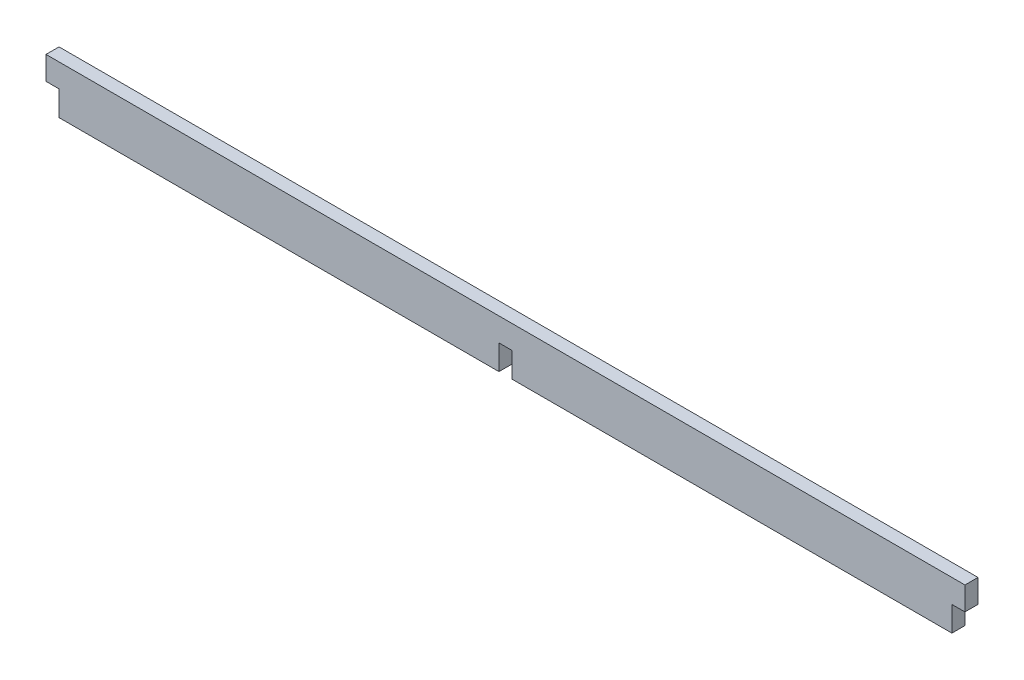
from build123d import *

# Parameters (mm, degrees)
BOSS_EXTRUDE1_DEPTH = 3.2


with BuildPart() as part:
    # Sketch1 → Boss-Extrude1 (new body)
    with BuildSketch(Plane.XY):
        Polygon((114.315, 8.384348), (222.225, 8.384348), (222.225, 14.49), (225.425, 14.49), (225.425, 20.2223228), (0, 20.2223228), (0, 14.49), (3.2, 14.49), (3.2, 8.384348), (111.115, 8.384348), (111.115, 14.49), (114.315, 14.49), align=None)
    extrude(amount=BOSS_EXTRUDE1_DEPTH)


solid = part.part
